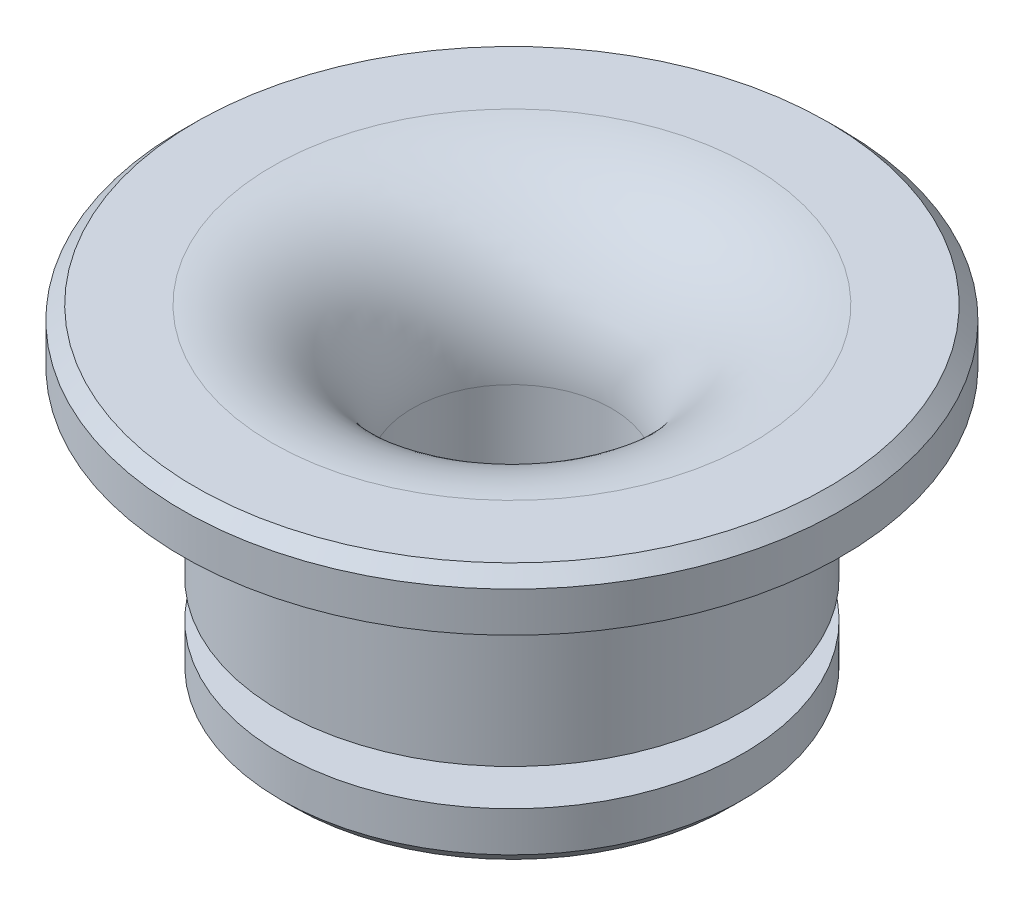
ISO-10303-21;
HEADER;
FILE_DESCRIPTION(('STEP AP214'),'2;1');
FILE_NAME('part.step','',(''),(''),'','','');
FILE_SCHEMA(('AUTOMOTIVE_DESIGN { 1 0 10303 214 1 1 1 1 }'));
ENDSEC;
DATA;
#1=APPLICATION_CONTEXT('core data for automotive mechanical design processes');
#2=APPLICATION_PROTOCOL_DEFINITION('international standard','automotive_design',2000,#1);
#3=PRODUCT_CONTEXT('',#1,'mechanical');
#4=PRODUCT('Part','Part','',(#3));
#5=PRODUCT_RELATED_PRODUCT_CATEGORY('part','',(#4));
#6=PRODUCT_DEFINITION_FORMATION('','',#4);
#7=PRODUCT_DEFINITION_CONTEXT('part definition',#1,'design');
#8=PRODUCT_DEFINITION('design','',#6,#7);
#9=PRODUCT_DEFINITION_SHAPE('','',#8);
#10=(LENGTH_UNIT() NAMED_UNIT(*) SI_UNIT(.MILLI.,.METRE.));
#11=(NAMED_UNIT(*) PLANE_ANGLE_UNIT() SI_UNIT($,.RADIAN.));
#12=(NAMED_UNIT(*) SI_UNIT($,.STERADIAN.) SOLID_ANGLE_UNIT());
#13=UNCERTAINTY_MEASURE_WITH_UNIT(LENGTH_MEASURE(1.E-05),#10,'distance_accuracy_value','');
#14=(GEOMETRIC_REPRESENTATION_CONTEXT(3) GLOBAL_UNCERTAINTY_ASSIGNED_CONTEXT((#13)) GLOBAL_UNIT_ASSIGNED_CONTEXT((#10,
#11,#12)) REPRESENTATION_CONTEXT('',''));
#15=CARTESIAN_POINT('',(0.,0.,0.));
#16=DIRECTION('',(0.,0.,1.));
#17=DIRECTION('',(1.,0.,0.));
#18=AXIS2_PLACEMENT_3D('',#15,#16,#17);
#19=CARTESIAN_POINT('',(0.,-8.,0.));
#20=DIRECTION('',(0.,-1.,0.));
#21=DIRECTION('',(0.,0.,-1.));
#22=AXIS2_PLACEMENT_3D('',#19,#20,#21);
#23=CYLINDRICAL_SURFACE('',#22,9.9);
#24=CARTESIAN_POINT('',(0.,-0.399999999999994,0.));
#25=DIRECTION('',(0.,-1.,0.));
#26=DIRECTION('',(0.,0.,-1.));
#27=AXIS2_PLACEMENT_3D('',#24,#25,#26);
#28=CIRCLE('',#27,9.9);
#29=CARTESIAN_POINT('',(0.,-0.399999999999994,-9.9));
#30=VERTEX_POINT('',#29);
#31=EDGE_CURVE('E47',#30,#30,#28,.T.);
#32=ORIENTED_EDGE('',*,*,#31,.T.);
#33=EDGE_LOOP('',(#32));
#34=FACE_BOUND('',#33,.T.);
#35=CARTESIAN_POINT('',(0.,-1.6,0.));
#36=DIRECTION('',(0.,-1.,0.));
#37=DIRECTION('',(0.,0.,-1.));
#38=AXIS2_PLACEMENT_3D('',#35,#36,#37);
#39=CIRCLE('',#38,9.9);
#40=CARTESIAN_POINT('',(0.,-1.6,-9.9));
#41=VERTEX_POINT('',#40);
#42=EDGE_CURVE('E99',#41,#41,#39,.T.);
#43=ORIENTED_EDGE('',*,*,#42,.F.);
#44=EDGE_LOOP('',(#43));
#45=FACE_BOUND('',#44,.T.);
#46=ADVANCED_FACE('F39',(#34,#45),#23,.T.);
#47=CARTESIAN_POINT('',(-7.2,0.,0.));
#48=DIRECTION('',(0.,-1.,0.));
#49=DIRECTION('',(0.,0.,-1.));
#50=AXIS2_PLACEMENT_3D('',#47,#48,#49);
#51=PLANE('',#50);
#52=CARTESIAN_POINT('',(0.,0.,0.));
#53=DIRECTION('',(0.,-1.,0.));
#54=DIRECTION('',(0.,0.,-1.));
#55=AXIS2_PLACEMENT_3D('',#52,#53,#54);
#56=CIRCLE('',#55,9.50000000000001);
#57=CARTESIAN_POINT('',(0.,0.,-9.50000000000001));
#58=VERTEX_POINT('',#57);
#59=EDGE_CURVE('E10',#58,#58,#56,.F.);
#60=ORIENTED_EDGE('',*,*,#59,.T.);
#61=EDGE_LOOP('',(#60));
#62=FACE_BOUND('',#61,.T.);
#63=CARTESIAN_POINT('',(0.,0.,0.));
#64=DIRECTION('',(0.,-1.,0.));
#65=DIRECTION('',(0.,0.,-1.));
#66=AXIS2_PLACEMENT_3D('',#63,#64,#65);
#67=CIRCLE('',#66,7.2);
#68=CARTESIAN_POINT('',(0.,0.,-7.2));
#69=VERTEX_POINT('',#68);
#70=EDGE_CURVE('E71',#69,#69,#67,.T.);
#71=ORIENTED_EDGE('',*,*,#70,.T.);
#72=EDGE_LOOP('',(#71));
#73=FACE_BOUND('',#72,.T.);
#74=ADVANCED_FACE('F107',(#62,#73),#51,.F.);
#75=CARTESIAN_POINT('',(0.,-4.2,0.));
#76=DIRECTION('',(0.,-1.,0.));
#77=DIRECTION('',(0.,0.,-1.));
#78=AXIS2_PLACEMENT_3D('',#75,#76,#77);
#79=TOROIDAL_SURFACE('',#78,7.2,4.2);
#80=ORIENTED_EDGE('',*,*,#70,.F.);
#81=EDGE_LOOP('',(#80));
#82=FACE_BOUND('',#81,.T.);
#83=CARTESIAN_POINT('',(0.,-4.2,0.));
#84=DIRECTION('',(0.,-1.,0.));
#85=DIRECTION('',(0.,0.,-1.));
#86=AXIS2_PLACEMENT_3D('',#83,#84,#85);
#87=CIRCLE('',#86,3.);
#88=CARTESIAN_POINT('',(0.,-4.2,-3.));
#89=VERTEX_POINT('',#88);
#90=EDGE_CURVE('E75',#89,#89,#87,.T.);
#91=ORIENTED_EDGE('',*,*,#90,.T.);
#92=EDGE_LOOP('',(#91));
#93=FACE_BOUND('',#92,.T.);
#94=ADVANCED_FACE('F112',(#82,#93),#79,.T.);
#95=CARTESIAN_POINT('',(0.,-8.,0.));
#96=DIRECTION('',(0.,-1.,0.));
#97=DIRECTION('',(0.,0.,-1.));
#98=AXIS2_PLACEMENT_3D('',#95,#96,#97);
#99=CYLINDRICAL_SURFACE('',#98,3.);
#100=CARTESIAN_POINT('',(0.,-9.4,0.));
#101=DIRECTION('',(0.,1.,0.));
#102=DIRECTION('',(0.,0.,1.));
#103=AXIS2_PLACEMENT_3D('',#100,#101,#102);
#104=CIRCLE('',#103,3.);
#105=CARTESIAN_POINT('',(0.,-9.4,-3.));
#106=VERTEX_POINT('',#105);
#107=EDGE_CURVE('E52',#106,#106,#104,.F.);
#108=ORIENTED_EDGE('',*,*,#107,.T.);
#109=EDGE_LOOP('',(#108));
#110=FACE_BOUND('',#109,.T.);
#111=ORIENTED_EDGE('',*,*,#90,.F.);
#112=EDGE_LOOP('',(#111));
#113=FACE_BOUND('',#112,.T.);
#114=ADVANCED_FACE('F130',(#110,#113),#99,.F.);
#115=CARTESIAN_POINT('',(-6.95,-9.8,0.));
#116=DIRECTION('',(0.,1.,0.));
#117=DIRECTION('',(0.,0.,1.));
#118=AXIS2_PLACEMENT_3D('',#115,#116,#117);
#119=PLANE('',#118);
#120=CARTESIAN_POINT('',(0.,-9.8,0.));
#121=DIRECTION('',(0.,1.,0.));
#122=DIRECTION('',(0.,0.,1.));
#123=AXIS2_PLACEMENT_3D('',#120,#121,#122);
#124=CIRCLE('',#123,6.55);
#125=CARTESIAN_POINT('',(0.,-9.8,6.55));
#126=VERTEX_POINT('',#125);
#127=EDGE_CURVE('E63',#126,#126,#124,.F.);
#128=ORIENTED_EDGE('',*,*,#127,.T.);
#129=EDGE_LOOP('',(#128));
#130=FACE_BOUND('',#129,.T.);
#131=CARTESIAN_POINT('',(0.,-9.8,0.));
#132=DIRECTION('',(0.,1.,0.));
#133=DIRECTION('',(0.,0.,1.));
#134=AXIS2_PLACEMENT_3D('',#131,#132,#133);
#135=CIRCLE('',#134,3.4);
#136=CARTESIAN_POINT('',(0.,-9.8,-3.4));
#137=VERTEX_POINT('',#136);
#138=EDGE_CURVE('E67',#137,#137,#135,.T.);
#139=ORIENTED_EDGE('',*,*,#138,.T.);
#140=EDGE_LOOP('',(#139));
#141=FACE_BOUND('',#140,.T.);
#142=ADVANCED_FACE('F133',(#130,#141),#119,.F.);
#143=CARTESIAN_POINT('',(0.,-8.,0.));
#144=DIRECTION('',(0.,-1.,0.));
#145=DIRECTION('',(0.,0.,-1.));
#146=AXIS2_PLACEMENT_3D('',#143,#144,#145);
#147=CYLINDRICAL_SURFACE('',#146,6.95);
#148=CARTESIAN_POINT('',(0.,-9.4,0.));
#149=DIRECTION('',(0.,1.,0.));
#150=DIRECTION('',(0.,0.,1.));
#151=AXIS2_PLACEMENT_3D('',#148,#149,#150);
#152=CIRCLE('',#151,6.95);
#153=CARTESIAN_POINT('',(0.,-9.4,6.95));
#154=VERTEX_POINT('',#153);
#155=EDGE_CURVE('E57',#154,#154,#152,.T.);
#156=ORIENTED_EDGE('',*,*,#155,.T.);
#157=EDGE_LOOP('',(#156));
#158=FACE_BOUND('',#157,.T.);
#159=CARTESIAN_POINT('',(0.,-8.2,0.));
#160=DIRECTION('',(0.,-1.,0.));
#161=DIRECTION('',(0.,0.,-1.));
#162=AXIS2_PLACEMENT_3D('',#159,#160,#161);
#163=CIRCLE('',#162,6.95);
#164=CARTESIAN_POINT('',(0.,-8.2,-6.95));
#165=VERTEX_POINT('',#164);
#166=EDGE_CURVE('E79',#165,#165,#163,.T.);
#167=ORIENTED_EDGE('',*,*,#166,.T.);
#168=EDGE_LOOP('',(#167));
#169=FACE_BOUND('',#168,.T.);
#170=ADVANCED_FACE('F145',(#158,#169),#147,.T.);
#171=CARTESIAN_POINT('',(-5.,-8.2,0.));
#172=DIRECTION('',(0.,-1.,0.));
#173=DIRECTION('',(0.,0.,-1.));
#174=AXIS2_PLACEMENT_3D('',#171,#172,#173);
#175=PLANE('',#174);
#176=ORIENTED_EDGE('',*,*,#166,.F.);
#177=EDGE_LOOP('',(#176));
#178=FACE_BOUND('',#177,.T.);
#179=CARTESIAN_POINT('',(0.,-8.2,0.));
#180=DIRECTION('',(0.,-1.,0.));
#181=DIRECTION('',(0.,0.,-1.));
#182=AXIS2_PLACEMENT_3D('',#179,#180,#181);
#183=CIRCLE('',#182,5.);
#184=CARTESIAN_POINT('',(0.,-8.2,-5.));
#185=VERTEX_POINT('',#184);
#186=EDGE_CURVE('E83',#185,#185,#183,.T.);
#187=ORIENTED_EDGE('',*,*,#186,.T.);
#188=EDGE_LOOP('',(#187));
#189=FACE_BOUND('',#188,.T.);
#190=ADVANCED_FACE('F149',(#178,#189),#175,.F.);
#191=CARTESIAN_POINT('',(0.,-8.,0.));
#192=DIRECTION('',(0.,-1.,0.));
#193=DIRECTION('',(0.,0.,-1.));
#194=AXIS2_PLACEMENT_3D('',#191,#192,#193);
#195=CYLINDRICAL_SURFACE('',#194,5.);
#196=ORIENTED_EDGE('',*,*,#186,.F.);
#197=EDGE_LOOP('',(#196));
#198=FACE_BOUND('',#197,.T.);
#199=CARTESIAN_POINT('',(0.,-7.1,0.));
#200=DIRECTION('',(0.,-1.,0.));
#201=DIRECTION('',(0.,0.,-1.));
#202=AXIS2_PLACEMENT_3D('',#199,#200,#201);
#203=CIRCLE('',#202,5.);
#204=CARTESIAN_POINT('',(0.,-7.1,-5.));
#205=VERTEX_POINT('',#204);
#206=EDGE_CURVE('E87',#205,#205,#203,.T.);
#207=ORIENTED_EDGE('',*,*,#206,.T.);
#208=EDGE_LOOP('',(#207));
#209=FACE_BOUND('',#208,.T.);
#210=ADVANCED_FACE('F153',(#198,#209),#195,.T.);
#211=CARTESIAN_POINT('',(-5.,-7.1,0.));
#212=DIRECTION('',(0.,1.,0.));
#213=DIRECTION('',(0.,0.,1.));
#214=AXIS2_PLACEMENT_3D('',#211,#212,#213);
#215=PLANE('',#214);
#216=ORIENTED_EDGE('',*,*,#206,.F.);
#217=EDGE_LOOP('',(#216));
#218=FACE_BOUND('',#217,.T.);
#219=CARTESIAN_POINT('',(0.,-7.1,0.));
#220=DIRECTION('',(0.,-1.,0.));
#221=DIRECTION('',(0.,0.,-1.));
#222=AXIS2_PLACEMENT_3D('',#219,#220,#221);
#223=CIRCLE('',#222,6.95);
#224=CARTESIAN_POINT('',(0.,-7.1,-6.95));
#225=VERTEX_POINT('',#224);
#226=EDGE_CURVE('E91',#225,#225,#223,.T.);
#227=ORIENTED_EDGE('',*,*,#226,.T.);
#228=EDGE_LOOP('',(#227));
#229=FACE_BOUND('',#228,.T.);
#230=ADVANCED_FACE('F157',(#218,#229),#215,.F.);
#231=CARTESIAN_POINT('',(0.,-8.,0.));
#232=DIRECTION('',(0.,-1.,0.));
#233=DIRECTION('',(0.,0.,-1.));
#234=AXIS2_PLACEMENT_3D('',#231,#232,#233);
#235=CYLINDRICAL_SURFACE('',#234,6.95);
#236=ORIENTED_EDGE('',*,*,#226,.F.);
#237=EDGE_LOOP('',(#236));
#238=FACE_BOUND('',#237,.T.);
#239=CARTESIAN_POINT('',(0.,-1.6,0.));
#240=DIRECTION('',(0.,-1.,0.));
#241=DIRECTION('',(0.,0.,-1.));
#242=AXIS2_PLACEMENT_3D('',#239,#240,#241);
#243=CIRCLE('',#242,6.95);
#244=CARTESIAN_POINT('',(0.,-1.6,-6.95));
#245=VERTEX_POINT('',#244);
#246=EDGE_CURVE('E95',#245,#245,#243,.T.);
#247=ORIENTED_EDGE('',*,*,#246,.T.);
#248=EDGE_LOOP('',(#247));
#249=FACE_BOUND('',#248,.T.);
#250=ADVANCED_FACE('F161',(#238,#249),#235,.T.);
#251=CARTESIAN_POINT('',(-9.9,-1.6,0.));
#252=DIRECTION('',(0.,1.,0.));
#253=DIRECTION('',(0.,0.,1.));
#254=AXIS2_PLACEMENT_3D('',#251,#252,#253);
#255=PLANE('',#254);
#256=ORIENTED_EDGE('',*,*,#246,.F.);
#257=EDGE_LOOP('',(#256));
#258=FACE_BOUND('',#257,.T.);
#259=ORIENTED_EDGE('',*,*,#42,.T.);
#260=EDGE_LOOP('',(#259));
#261=FACE_BOUND('',#260,.T.);
#262=ADVANCED_FACE('F104',(#258,#261),#255,.F.);
#263=CARTESIAN_POINT('',(0.,-9.8,0.));
#264=DIRECTION('',(0.,1.,0.));
#265=DIRECTION('',(0.,0.,1.));
#266=AXIS2_PLACEMENT_3D('',#263,#264,#265);
#267=CONICAL_SURFACE('',#266,6.55,0.785398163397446);
#268=ORIENTED_EDGE('',*,*,#155,.F.);
#269=EDGE_LOOP('',(#268));
#270=FACE_BOUND('',#269,.T.);
#271=ORIENTED_EDGE('',*,*,#127,.F.);
#272=EDGE_LOOP('',(#271));
#273=FACE_BOUND('',#272,.T.);
#274=ADVANCED_FACE('F116',(#270,#273),#267,.T.);
#275=CARTESIAN_POINT('',(0.,-9.4,0.));
#276=DIRECTION('',(0.,-1.,0.));
#277=DIRECTION('',(0.,0.,-1.));
#278=AXIS2_PLACEMENT_3D('',#275,#276,#277);
#279=CONICAL_SURFACE('',#278,3.,0.785398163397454);
#280=CARTESIAN_POINT('',(0.,-9.8,-3.4));
#281=CARTESIAN_POINT('',(0.,-9.79583333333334,-3.39583333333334));
#282=CARTESIAN_POINT('',(0.,-9.79166666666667,-3.39166666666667));
#283=CARTESIAN_POINT('',(0.,-9.78333333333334,-3.38333333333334));
#284=CARTESIAN_POINT('',(0.,-9.77916666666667,-3.37916666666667));
#285=CARTESIAN_POINT('',(0.,-9.77083333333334,-3.37083333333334));
#286=CARTESIAN_POINT('',(0.,-9.76666666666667,-3.36666666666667));
#287=CARTESIAN_POINT('',(0.,-9.75833333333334,-3.35833333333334));
#288=CARTESIAN_POINT('',(0.,-9.75416666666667,-3.35416666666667));
#289=CARTESIAN_POINT('',(0.,-9.74583333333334,-3.34583333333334));
#290=CARTESIAN_POINT('',(0.,-9.74166666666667,-3.34166666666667));
#291=CARTESIAN_POINT('',(0.,-9.73333333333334,-3.33333333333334));
#292=CARTESIAN_POINT('',(0.,-9.72916666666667,-3.32916666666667));
#293=CARTESIAN_POINT('',(0.,-9.72083333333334,-3.32083333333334));
#294=CARTESIAN_POINT('',(0.,-9.71666666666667,-3.31666666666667));
#295=CARTESIAN_POINT('',(0.,-9.70833333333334,-3.30833333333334));
#296=CARTESIAN_POINT('',(0.,-9.70416666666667,-3.30416666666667));
#297=CARTESIAN_POINT('',(0.,-9.69583333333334,-3.29583333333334));
#298=CARTESIAN_POINT('',(0.,-9.69166666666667,-3.29166666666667));
#299=CARTESIAN_POINT('',(0.,-9.68333333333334,-3.28333333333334));
#300=CARTESIAN_POINT('',(0.,-9.67916666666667,-3.27916666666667));
#301=CARTESIAN_POINT('',(0.,-9.67083333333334,-3.27083333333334));
#302=CARTESIAN_POINT('',(0.,-9.66666666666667,-3.26666666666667));
#303=CARTESIAN_POINT('',(0.,-9.65833333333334,-3.25833333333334));
#304=CARTESIAN_POINT('',(0.,-9.65416666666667,-3.25416666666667));
#305=CARTESIAN_POINT('',(0.,-9.64583333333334,-3.24583333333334));
#306=CARTESIAN_POINT('',(0.,-9.64166666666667,-3.24166666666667));
#307=CARTESIAN_POINT('',(0.,-9.63333333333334,-3.23333333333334));
#308=CARTESIAN_POINT('',(0.,-9.62916666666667,-3.22916666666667));
#309=CARTESIAN_POINT('',(0.,-9.62083333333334,-3.22083333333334));
#310=CARTESIAN_POINT('',(0.,-9.61666666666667,-3.21666666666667));
#311=CARTESIAN_POINT('',(0.,-9.60833333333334,-3.20833333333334));
#312=CARTESIAN_POINT('',(0.,-9.60416666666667,-3.20416666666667));
#313=CARTESIAN_POINT('',(0.,-9.59583333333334,-3.19583333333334));
#314=CARTESIAN_POINT('',(0.,-9.59166666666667,-3.19166666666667));
#315=CARTESIAN_POINT('',(0.,-9.58333333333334,-3.18333333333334));
#316=CARTESIAN_POINT('',(0.,-9.57916666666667,-3.17916666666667));
#317=CARTESIAN_POINT('',(0.,-9.57083333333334,-3.17083333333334));
#318=CARTESIAN_POINT('',(0.,-9.56666666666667,-3.16666666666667));
#319=CARTESIAN_POINT('',(0.,-9.55833333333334,-3.15833333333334));
#320=CARTESIAN_POINT('',(0.,-9.55416666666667,-3.15416666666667));
#321=CARTESIAN_POINT('',(0.,-9.54583333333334,-3.14583333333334));
#322=CARTESIAN_POINT('',(0.,-9.54166666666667,-3.14166666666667));
#323=CARTESIAN_POINT('',(0.,-9.53333333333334,-3.13333333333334));
#324=CARTESIAN_POINT('',(0.,-9.52916666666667,-3.12916666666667));
#325=CARTESIAN_POINT('',(0.,-9.52083333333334,-3.12083333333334));
#326=CARTESIAN_POINT('',(0.,-9.51666666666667,-3.11666666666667));
#327=CARTESIAN_POINT('',(0.,-9.50833333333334,-3.10833333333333));
#328=CARTESIAN_POINT('',(0.,-9.50416666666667,-3.10416666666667));
#329=CARTESIAN_POINT('',(0.,-9.49583333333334,-3.09583333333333));
#330=CARTESIAN_POINT('',(0.,-9.49166666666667,-3.09166666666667));
#331=CARTESIAN_POINT('',(0.,-9.48333333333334,-3.08333333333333));
#332=CARTESIAN_POINT('',(0.,-9.47916666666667,-3.07916666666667));
#333=CARTESIAN_POINT('',(0.,-9.47083333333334,-3.07083333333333));
#334=CARTESIAN_POINT('',(0.,-9.46666666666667,-3.06666666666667));
#335=CARTESIAN_POINT('',(0.,-9.45833333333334,-3.05833333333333));
#336=CARTESIAN_POINT('',(0.,-9.45416666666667,-3.05416666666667));
#337=CARTESIAN_POINT('',(0.,-9.44583333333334,-3.04583333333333));
#338=CARTESIAN_POINT('',(0.,-9.44166666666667,-3.04166666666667));
#339=CARTESIAN_POINT('',(0.,-9.43333333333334,-3.03333333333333));
#340=CARTESIAN_POINT('',(0.,-9.42916666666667,-3.02916666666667));
#341=CARTESIAN_POINT('',(0.,-9.42083333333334,-3.02083333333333));
#342=CARTESIAN_POINT('',(0.,-9.41666666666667,-3.01666666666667));
#343=CARTESIAN_POINT('',(0.,-9.40833333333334,-3.00833333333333));
#344=CARTESIAN_POINT('',(0.,-9.40416666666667,-3.00416666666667));
#345=CARTESIAN_POINT('',(0.,-9.4,-3.));
#346=B_SPLINE_CURVE_WITH_KNOTS('',3,(#280,#281,#282,#283,#284,#285,#286,#287,#288,#289,#290,
#291,#292,#293,#294,#295,#296,#297,#298,#299,#300,#301,#302,#303,#304,#305,#306,#307,#308,#309,
#310,#311,#312,#313,#314,#315,#316,#317,#318,#319,#320,#321,#322,#323,#324,#325,#326,#327,#328,
#329,#330,#331,#332,#333,#334,#335,#336,#337,#338,#339,#340,#341,#342,#343,#344,#345),
.UNSPECIFIED.,.F.,.F.,(4,2,2,2,2,2,2,2,2,2,2,2,2,2,2,2,2,2,2,2,2,2,2,2,2,2,2,2,2,2,2,2,4),(0.,
0.0176776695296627,0.0353553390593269,0.0530330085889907,0.0707106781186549,0.0883883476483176,
0.106066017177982,0.123743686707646,0.14142135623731,0.159099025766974,0.176776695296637,
0.194454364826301,0.212132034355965,0.229809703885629,0.247487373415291,0.265165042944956,
0.28284271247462,0.300520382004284,0.318198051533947,0.33587572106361,0.353553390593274,
0.371231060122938,0.388908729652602,0.406586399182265,0.424264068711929,0.441941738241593,
0.459619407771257,0.477297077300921,0.494974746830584,0.512652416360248,0.530330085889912,
0.548007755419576,0.56568542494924),.UNSPECIFIED.);
#347=EDGE_CURVE('BSEAM118',#137,#106,#346,.T.);
#348=ORIENTED_EDGE('',*,*,#138,.F.);
#349=ORIENTED_EDGE('',*,*,#107,.F.);
#350=ORIENTED_EDGE('',*,*,#347,.T.);
#351=ORIENTED_EDGE('',*,*,#347,.F.);
#352=EDGE_LOOP('',(#348,#350,#349,#351));
#353=FACE_BOUND('',#352,.T.);
#354=ADVANCED_FACE('F118',(#353),#279,.F.);
#355=CARTESIAN_POINT('',(0.,-0.399999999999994,0.));
#356=DIRECTION('',(0.,-1.,0.));
#357=DIRECTION('',(0.,0.,-1.));
#358=AXIS2_PLACEMENT_3D('',#355,#356,#357);
#359=CONICAL_SURFACE('',#358,9.9,0.78539816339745);
#360=ORIENTED_EDGE('',*,*,#59,.F.);
#361=EDGE_LOOP('',(#360));
#362=FACE_BOUND('',#361,.T.);
#363=ORIENTED_EDGE('',*,*,#31,.F.);
#364=EDGE_LOOP('',(#363));
#365=FACE_BOUND('',#364,.T.);
#366=ADVANCED_FACE('F41',(#362,#365),#359,.T.);
#367=CLOSED_SHELL('',(#46,#74,#94,#114,#142,#170,#190,#210,#230,#250,#262,#274,#354,#366));
#368=MANIFOLD_SOLID_BREP('B2',#367);
#369=ADVANCED_BREP_SHAPE_REPRESENTATION('',(#18,#368),#14);
#370=SHAPE_DEFINITION_REPRESENTATION(#9,#369);
ENDSEC;
END-ISO-10303-21;
